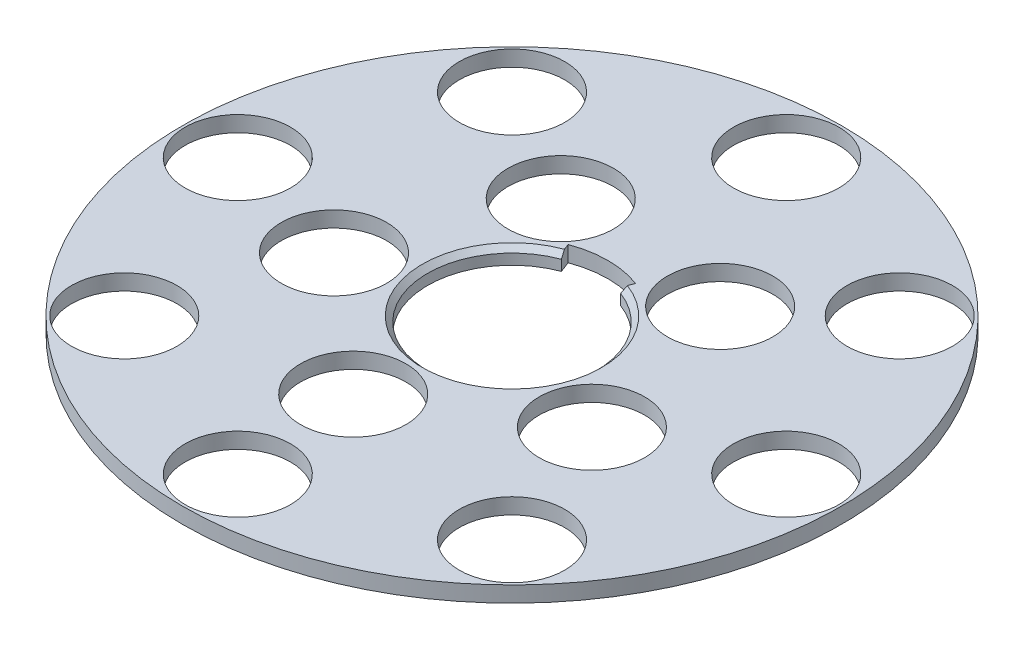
from build123d import *

# Parameters (mm, degrees)
SKETCH1_R           = 31.25
BOSS_EXTRUDE1_DEPTH = 1.5
CHAMFER1_SIZE       = 0.5
SKETCH2_R           = 5
CUT_EXTRUDE1_DEPTH  = 45.219622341
CIRPATTERN1_COUNT   = 8
SKETCH3_R           = 5
CUT_EXTRUDE2_DEPTH  = 45.219622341
CIRPATTERN2_COUNT   = 5


with BuildPart() as part:
    # Sketch1 → Boss-Extrude1 (new body)
    with BuildSketch(Plane(origin=(0, 0, 0), x_dir=(1, 0, 0), z_dir=(0, 1, 0))):
        with Locations(Location((0, 0, 0), (0, 0, 270))):
            Circle(SKETCH1_R)
        with BuildLine():
            Line((2.808987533, 7.490633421), (3, 8))
            Line((3, 8), (3.195223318, 8.520595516))
            ThreePointArc((3.195223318, 8.520595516), (0, 9.1), (-3.195223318, 8.520595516))
            Line((-3.195223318, 8.520595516), (-3, 8))
            Line((-3, 8), (-2.808987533, 7.490633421))
            ThreePointArc((-2.808987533, 7.490633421), (0, -8), (2.808987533, 7.490633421))
        make_face(mode=Mode.SUBTRACT)
    extrude(amount=-BOSS_EXTRUDE1_DEPTH)

    # Chamfer1
    chamfer1_edges = [part.edges().sort_by_distance(p)[0] for p in [
        (0, 0, 8),
    ]]
    chamfer(chamfer1_edges, length=CHAMFER1_SIZE)

    # Sketch2 → Cut-Extrude1 (cut, through all)
    with BuildSketch(Plane(origin=(0, 0, 0), x_dir=(1, 0, 0), z_dir=(0, 1, 0))):
        with Locations(Location((0, 26, 0), (0, 0, 270))):
            Circle(SKETCH2_R)
    cut_extrude1 = extrude(amount=-CUT_EXTRUDE1_DEPTH, mode=Mode.SUBTRACT)

    # CirPattern1: Cut-Extrude1 ×8 about axis
    cirpattern1_axis = Axis((0, 0, 0), (0, 1, 0))
    for i in range(1, CIRPATTERN1_COUNT):
        add(cut_extrude1.rotate(cirpattern1_axis, i * 360 / CIRPATTERN1_COUNT), mode=Mode.SUBTRACT)

    # Sketch3 → Cut-Extrude2 (cut, through all)
    with BuildSketch(Plane(origin=(0, 0, 0), x_dir=(1, 0, 0), z_dir=(0, 1, 0))):
        with Locations(Location((12.934313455, -5.357568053, 0), (0, 0, 270))):
            Circle(SKETCH3_R)
    cut_extrude2 = extrude(amount=-CUT_EXTRUDE2_DEPTH, mode=Mode.SUBTRACT)

    # CirPattern2: Cut-Extrude2 ×5 about axis
    cirpattern2_axis = Axis((0, 0, 0), (0, 1, 0))
    for i in range(1, CIRPATTERN2_COUNT):
        add(cut_extrude2.rotate(cirpattern2_axis, i * 360 / CIRPATTERN2_COUNT), mode=Mode.SUBTRACT)


solid = part.part
